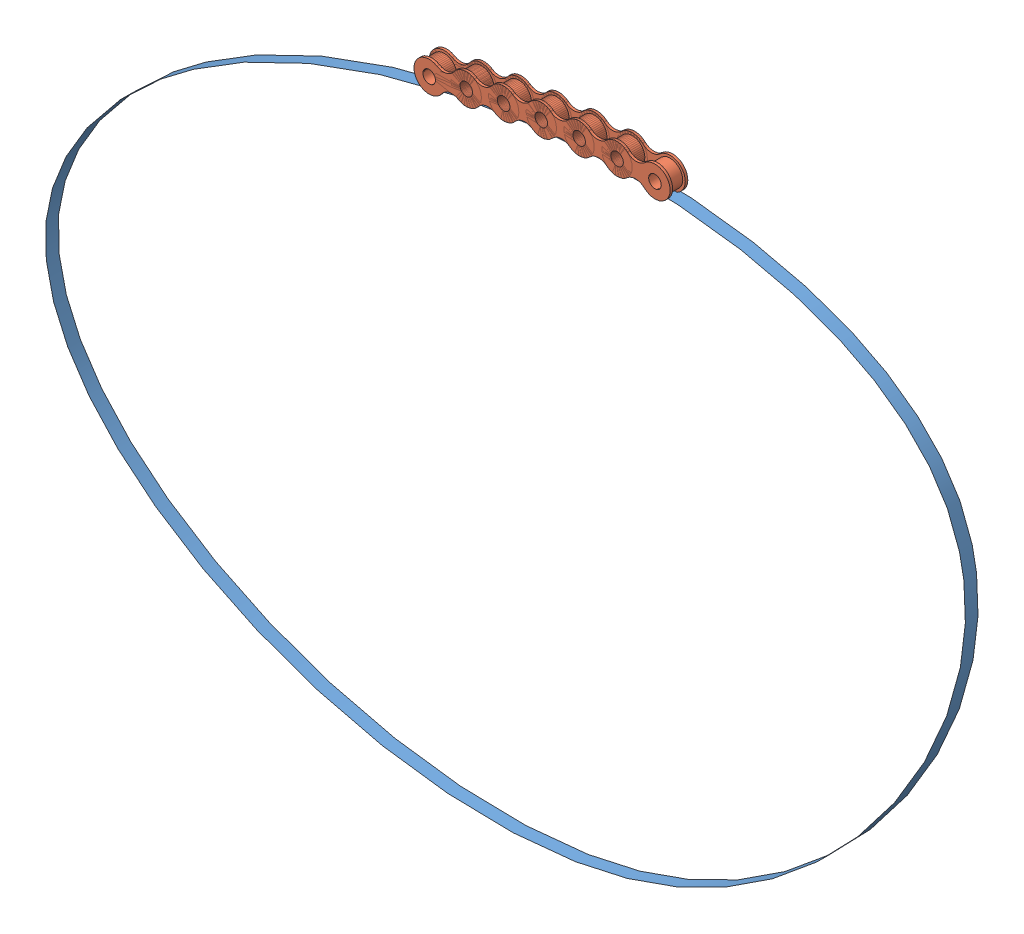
SolidWorks assembly kette.SLDASM, configuration Standard (file format 3400). Lengths in mm.
Overall size (373.04 267.31 7).
8 component instances, 2 part files, 21 mates.
Components (placement in the parent):
- BAHN-1: BAHN.SLDPRT [Standard] at (-3.7535 106.7741 0) size (373.04 256.92 5)
- KETTENGLIED-1: KETTENGLIED.SLDPRT [Standard] at (-15.5155 208.5666 3.5) x (-0.978398 -0.206729 0) z (0 0 1) size (27 12 7)
- KETTENGLIED-2: KETTENGLIED.SLDPRT [Standard] at (-30.1915 205.4657 3.5) x (0.978398 0.206729 0) z (0 0 1) size (27 12 7)
- KETTENGLIED-3: KETTENGLIED.SLDPRT [Standard] at (-15.5155 208.5666 3.5) x (0.986417 0.164259 0) z (0 0 1) size (27 12 7)
- KETTENGLIED-4: KETTENGLIED.SLDPRT [Standard] at (-0.7192 211.0305 3.5) x (0.992613 0.12132 0) z (0 0 1) size (27 12 7)
- KETTENGLIED-5: KETTENGLIED.SLDPRT [Standard] at (14.17 212.8503 3.5) x (0.997011 0.077264 0) z (0 0 1) size (27 12 7)
- KETTENGLIED-6: KETTENGLIED.SLDPRT [Standard] at (29.1251 214.0092 3.5) x (0.999509 0.031346 0) z (0 0 1) size (27 12 7)
- KETTENGLIED-7: KETTENGLIED.SLDPRT [Standard] at (44.1177 214.4794 3.5) x (0.99985 -0.017323 0) z (0 0 1) size (27 12 7)
Mates (geometry in assembly coordinates):
- Deckungsgleich1: coincident anti-aligned: plane of KETTENGLIED-1 through (-27.6337 229.6399 0) normal (0 0 -1)
- Deckungsgleich2: coincident anti-aligned: unknown of KETTENGLIED-2
- Deckungsgleich3: coincident anti-aligned: unknown of KETTENGLIED-3
- Deckungsgleich4: coincident anti-aligned: unknown of KETTENGLIED-4
- Konzentrisch1: concentric anti-aligned: cylinder of KETTENGLIED-3; cylinder of KETTENGLIED-4
- Konzentrisch2: concentric anti-aligned: cylinder of KETTENGLIED-2; cylinder of KETTENGLIED-3
- Konzentrisch3: concentric anti-aligned: cylinder of KETTENGLIED-1; cylinder of KETTENGLIED-2
- Tangential1: tangent: face of BAHN-1; cylinder of KETTENGLIED-1
- Tangential2: tangent: face of BAHN-1; cylinder of KETTENGLIED-2
- Tangential4: tangent: face of BAHN-1; cylinder of KETTENGLIED-2
- Tangential5: tangent: face of BAHN-1; cylinder of KETTENGLIED-4
- Tangential6: tangent: face of BAHN-1; cylinder of KETTENGLIED-4
- Deckungsgleich5: coincident aligned: plane of KETTENGLIED-4 through (9.5307 188.9879 7) normal (0 0 1); plane of KETTENGLIED-5 through (23.4341 190.3756 7) normal (0 0 1)
- Deckungsgleich6: coincident aligned: plane of KETTENGLIED-5 through (23.4341 190.3756 7) normal (0 0 1); plane of KETTENGLIED-6 through (37.3463 191.1324 7) normal (0 0 1)
- Deckungsgleich7: coincident aligned: plane of KETTENGLIED-6 through (37.3463 191.1324 7) normal (0 0 1); plane of KETTENGLIED-7 through (51.2161 191.2297 7) normal (0 0 1)
- Konzentrisch4: concentric anti-aligned: cylinder of KETTENGLIED-4; cylinder of KETTENGLIED-5
- Konzentrisch5: concentric anti-aligned: cylinder of KETTENGLIED-5; cylinder of KETTENGLIED-6
- Konzentrisch6: concentric anti-aligned: cylinder of KETTENGLIED-6; cylinder of KETTENGLIED-7
- Tangential7: tangent: face of BAHN-1; cylinder of KETTENGLIED-5
- Tangential8: tangent: face of BAHN-1; cylinder of KETTENGLIED-7
- Tangential9: tangent: face of BAHN-1; cylinder of KETTENGLIED-7
